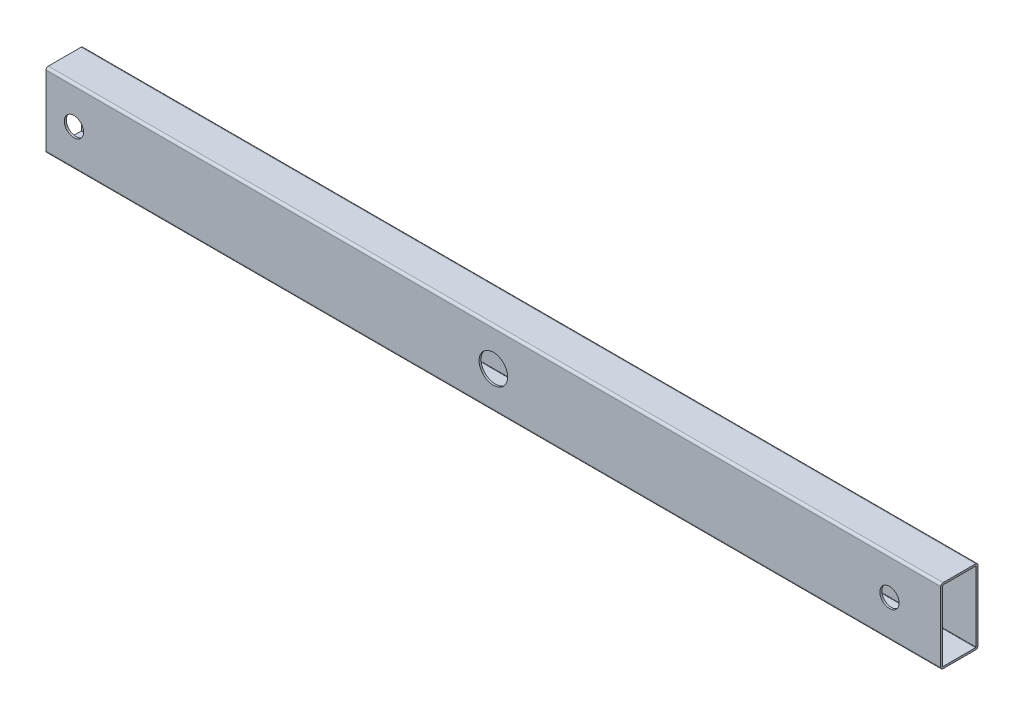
from build123d import *

# Parameters (mm, degrees)
EXTRUDE1_DEPTH          = 609.6
CUT_EXTRUDE1_DEPTH      = 612.772892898
CUT_EXTRUDE1_DEPTH_BACK = 612.772892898
SKETCH4_R               = 9.7234375
CUT_EXTRUDE2_DEPTH      = 612.772892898
CUT_EXTRUDE2_DEPTH_BACK = 612.772892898
SKETCH6_R               = 6.5484375
SKETCH7_R               = 6.5484375
CUT_EXTRUDE3_DEPTH      = 612.827301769


with BuildPart() as part:
    # Sketch1 → Extrude1 (new body)
    with BuildSketch(Plane(origin=(0, 0, 0), x_dir=(0, 0, -1), z_dir=(1, 0, 0))):
        with BuildLine():
            Line((-5.373037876, 5.244240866), (16.851962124, 5.244240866))
            ThreePointArc((16.851962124, 5.244240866), (17.974494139, 4.779272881), (18.439462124, 3.656740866))
            Line((18.439462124, 3.656740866), (18.439462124, -43.968259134))
            ThreePointArc((18.439462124, -43.968259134), (17.974494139, -45.090791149), (16.851962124, -45.555759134))
            Line((16.851962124, -45.555759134), (-5.373037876, -45.555759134))
            ThreePointArc((-5.373037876, -45.555759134), (-6.495569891, -45.090791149), (-6.960537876, -43.968259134))
            Line((-6.960537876, -43.968259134), (-6.960537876, 3.656740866))
            ThreePointArc((-6.960537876, 3.656740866), (-6.495569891, 4.779272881), (-5.373037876, 5.244240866))
        make_face()
        with BuildLine():
            Line((-5.373037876, 3.898040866), (16.851962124, 3.898040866))
            ThreePointArc((16.851962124, 3.898040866), (17.02258699, 3.827365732), (17.093262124, 3.656740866))
            Line((17.093262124, 3.656740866), (17.093262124, -43.968259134))
            ThreePointArc((17.093262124, -43.968259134), (17.02258699, -44.138884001), (16.851962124, -44.209559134))
            Line((16.851962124, -44.209559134), (-5.373037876, -44.209559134))
            ThreePointArc((-5.373037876, -44.209559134), (-5.543662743, -44.138884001), (-5.614337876, -43.968259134))
            Line((-5.614337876, -43.968259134), (-5.614337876, 3.656740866))
            ThreePointArc((-5.614337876, 3.656740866), (-5.543662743, 3.827365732), (-5.373037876, 3.898040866))
        make_face(mode=Mode.SUBTRACT)
    extrude(amount=EXTRUDE1_DEPTH)

    # Sketch4 → Cut-Extrude1 (cut, two sides: drawn at the far end of the back side and taken through both)
    with BuildSketch(Plane.XY.offset(-17.093262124).offset(-CUT_EXTRUDE1_DEPTH_BACK)):
        with Locations((304.8, -20.155759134)):
            Circle(SKETCH4_R)
    extrude(amount=CUT_EXTRUDE1_DEPTH + CUT_EXTRUDE1_DEPTH_BACK, mode=Mode.SUBTRACT)

    # Sketch6 → Cut-Extrude2 (cut, two sides: drawn at the far end of the back side and taken through both)
    with BuildSketch(Plane.XY.offset(-17.093262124).offset(-CUT_EXTRUDE2_DEPTH_BACK)):
        with Locations((19.05, -20.155759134)):
            Circle(SKETCH6_R)
    extrude(amount=CUT_EXTRUDE2_DEPTH + CUT_EXTRUDE2_DEPTH_BACK, mode=Mode.SUBTRACT)

    # Sketch7 → Cut-Extrude3 (cut, through all)
    with BuildSketch(Plane(origin=(0, 0, -18.439462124), x_dir=(-1, 0, 0), z_dir=(0, 0, -1))):
        with Locations(Location((-574.675, -20.155759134, 0), (0, 0, 90))):
            Circle(SKETCH7_R)
    extrude(amount=-CUT_EXTRUDE3_DEPTH, mode=Mode.SUBTRACT)


solid = part.part
